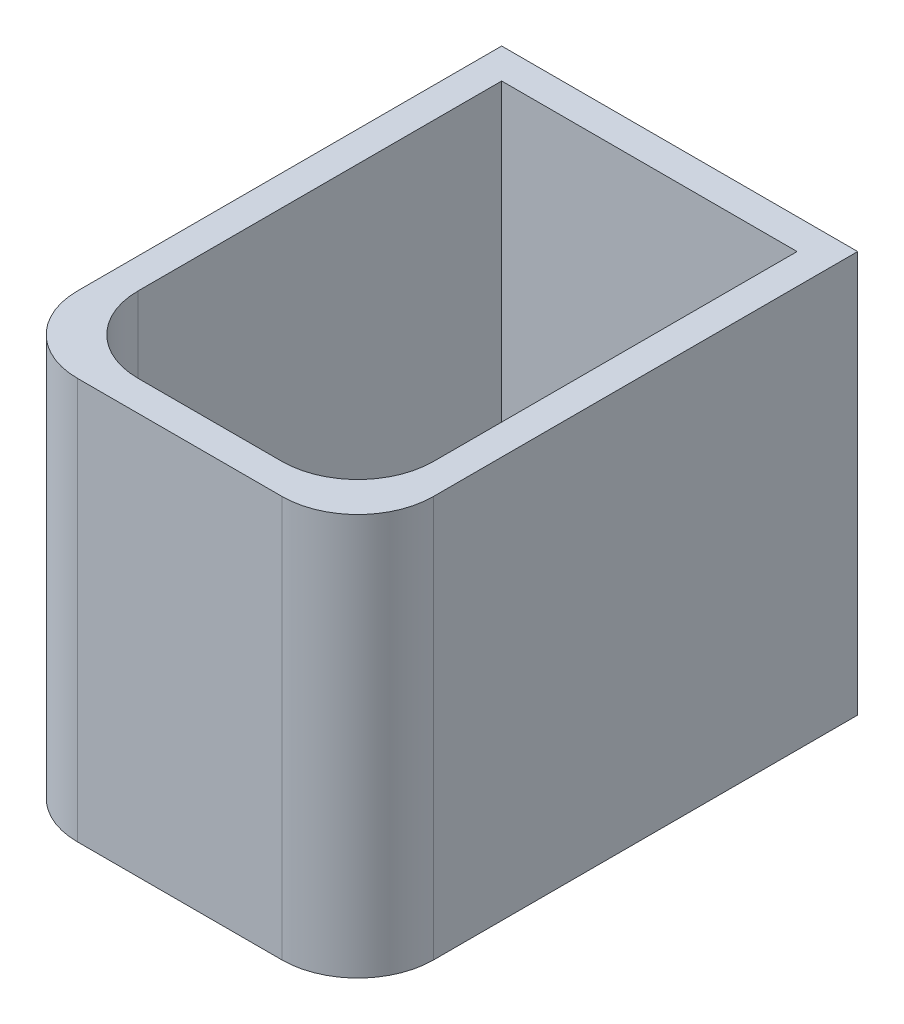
ISO-10303-21;
HEADER;
FILE_DESCRIPTION(('STEP AP214'),'2;1');
FILE_NAME('part.step','',(''),(''),'','','');
FILE_SCHEMA(('AUTOMOTIVE_DESIGN { 1 0 10303 214 1 1 1 1 }'));
ENDSEC;
DATA;
#1=APPLICATION_CONTEXT('core data for automotive mechanical design processes');
#2=APPLICATION_PROTOCOL_DEFINITION('international standard','automotive_design',2000,#1);
#3=PRODUCT_CONTEXT('',#1,'mechanical');
#4=PRODUCT('Part','Part','',(#3));
#5=PRODUCT_RELATED_PRODUCT_CATEGORY('part','',(#4));
#6=PRODUCT_DEFINITION_FORMATION('','',#4);
#7=PRODUCT_DEFINITION_CONTEXT('part definition',#1,'design');
#8=PRODUCT_DEFINITION('design','',#6,#7);
#9=PRODUCT_DEFINITION_SHAPE('','',#8);
#10=(LENGTH_UNIT() NAMED_UNIT(*) SI_UNIT(.MILLI.,.METRE.));
#11=(NAMED_UNIT(*) PLANE_ANGLE_UNIT() SI_UNIT($,.RADIAN.));
#12=(NAMED_UNIT(*) SI_UNIT($,.STERADIAN.) SOLID_ANGLE_UNIT());
#13=UNCERTAINTY_MEASURE_WITH_UNIT(LENGTH_MEASURE(1.E-05),#10,'distance_accuracy_value','');
#14=(GEOMETRIC_REPRESENTATION_CONTEXT(3) GLOBAL_UNCERTAINTY_ASSIGNED_CONTEXT((#13)) GLOBAL_UNIT_ASSIGNED_CONTEXT((#10,
#11,#12)) REPRESENTATION_CONTEXT('',''));
#15=CARTESIAN_POINT('',(0.,0.,0.));
#16=DIRECTION('',(0.,0.,1.));
#17=DIRECTION('',(1.,0.,0.));
#18=AXIS2_PLACEMENT_3D('',#15,#16,#17);
#19=CARTESIAN_POINT('',(2.35,0.3,3.3));
#20=DIRECTION('',(-1.,0.,0.));
#21=DIRECTION('',(0.,0.,1.));
#22=AXIS2_PLACEMENT_3D('',#19,#20,#21);
#23=PLANE('',#22);
#24=DIRECTION('',(0.,0.,-1.));
#25=VECTOR('',#24,1.);
#26=CARTESIAN_POINT('',(2.35,5.3,3.3));
#27=LINE('',#26,#25);
#28=CARTESIAN_POINT('',(2.35,5.3,2.3));
#29=VERTEX_POINT('',#28);
#30=CARTESIAN_POINT('',(2.35,5.3,-3.3));
#31=VERTEX_POINT('',#30);
#32=EDGE_CURVE('E141',#29,#31,#27,.T.);
#33=ORIENTED_EDGE('',*,*,#32,.F.);
#34=DIRECTION('',(0.,-1.,0.));
#35=VECTOR('',#34,1.);
#36=CARTESIAN_POINT('',(2.35,0.3,2.3));
#37=LINE('',#36,#35);
#38=CARTESIAN_POINT('',(2.35,0.,2.3));
#39=VERTEX_POINT('',#38);
#40=EDGE_CURVE('E214',#29,#39,#37,.T.);
#41=ORIENTED_EDGE('',*,*,#40,.T.);
#42=DIRECTION('',(0.,0.,-1.));
#43=VECTOR('',#42,1.);
#44=CARTESIAN_POINT('',(2.35,0.,3.3));
#45=LINE('',#44,#43);
#46=CARTESIAN_POINT('',(2.35,0.,-3.3));
#47=VERTEX_POINT('',#46);
#48=EDGE_CURVE('E172',#39,#47,#45,.T.);
#49=ORIENTED_EDGE('',*,*,#48,.T.);
#50=DIRECTION('',(0.,-1.,0.));
#51=VECTOR('',#50,1.);
#52=CARTESIAN_POINT('',(2.35,0.3,-3.3));
#53=LINE('',#52,#51);
#54=EDGE_CURVE('E185',#31,#47,#53,.T.);
#55=ORIENTED_EDGE('',*,*,#54,.F.);
#56=EDGE_LOOP('',(#33,#41,#49,#55));
#57=FACE_BOUND('',#56,.T.);
#58=ADVANCED_FACE('F36',(#57),#23,.F.);
#59=CARTESIAN_POINT('',(-2.35,0.3,-3.3));
#60=DIRECTION('',(0.,0.,1.));
#61=DIRECTION('',(1.,0.,0.));
#62=AXIS2_PLACEMENT_3D('',#59,#60,#61);
#63=PLANE('',#62);
#64=DIRECTION('',(-1.,0.,0.));
#65=VECTOR('',#64,1.);
#66=CARTESIAN_POINT('',(-2.35,0.,-3.3));
#67=LINE('',#66,#65);
#68=CARTESIAN_POINT('',(-2.35,0.,-3.3));
#69=VERTEX_POINT('',#68);
#70=EDGE_CURVE('E174',#47,#69,#67,.T.);
#71=ORIENTED_EDGE('',*,*,#70,.T.);
#72=DIRECTION('',(0.,-1.,0.));
#73=VECTOR('',#72,1.);
#74=CARTESIAN_POINT('',(-2.35,0.3,-3.3));
#75=LINE('',#74,#73);
#76=CARTESIAN_POINT('',(-2.35,5.3,-3.3));
#77=VERTEX_POINT('',#76);
#78=EDGE_CURVE('E182',#77,#69,#75,.T.);
#79=ORIENTED_EDGE('',*,*,#78,.F.);
#80=DIRECTION('',(-1.,0.,0.));
#81=VECTOR('',#80,1.);
#82=CARTESIAN_POINT('',(-2.35,5.3,-3.3));
#83=LINE('',#82,#81);
#84=EDGE_CURVE('E163',#31,#77,#83,.T.);
#85=ORIENTED_EDGE('',*,*,#84,.F.);
#86=ORIENTED_EDGE('',*,*,#54,.T.);
#87=EDGE_LOOP('',(#71,#79,#85,#86));
#88=FACE_BOUND('',#87,.T.);
#89=ADVANCED_FACE('F239',(#88),#63,.F.);
#90=CARTESIAN_POINT('',(-2.35,0.3,3.3));
#91=DIRECTION('',(1.,0.,0.));
#92=DIRECTION('',(0.,0.,-1.));
#93=AXIS2_PLACEMENT_3D('',#90,#91,#92);
#94=PLANE('',#93);
#95=DIRECTION('',(0.,0.,1.));
#96=VECTOR('',#95,1.);
#97=CARTESIAN_POINT('',(-2.35,0.,3.3));
#98=LINE('',#97,#96);
#99=CARTESIAN_POINT('',(-2.35,0.,2.3));
#100=VERTEX_POINT('',#99);
#101=EDGE_CURVE('E176',#69,#100,#98,.T.);
#102=ORIENTED_EDGE('',*,*,#101,.T.);
#103=DIRECTION('',(0.,-1.,0.));
#104=VECTOR('',#103,1.);
#105=CARTESIAN_POINT('',(-2.35,0.3,2.3));
#106=LINE('',#105,#104);
#107=CARTESIAN_POINT('',(-2.35,5.3,2.3));
#108=VERTEX_POINT('',#107);
#109=EDGE_CURVE('E197',#100,#108,#106,.F.);
#110=ORIENTED_EDGE('',*,*,#109,.T.);
#111=DIRECTION('',(0.,0.,1.));
#112=VECTOR('',#111,1.);
#113=CARTESIAN_POINT('',(-2.35,5.3,3.3));
#114=LINE('',#113,#112);
#115=EDGE_CURVE('E166',#77,#108,#114,.T.);
#116=ORIENTED_EDGE('',*,*,#115,.F.);
#117=ORIENTED_EDGE('',*,*,#78,.T.);
#118=EDGE_LOOP('',(#102,#110,#116,#117));
#119=FACE_BOUND('',#118,.T.);
#120=ADVANCED_FACE('F245',(#119),#94,.F.);
#121=CARTESIAN_POINT('',(-2.35,0.3,3.3));
#122=DIRECTION('',(0.,0.,-1.));
#123=DIRECTION('',(-1.,0.,0.));
#124=AXIS2_PLACEMENT_3D('',#121,#122,#123);
#125=PLANE('',#124);
#126=DIRECTION('',(1.,0.,0.));
#127=VECTOR('',#126,1.);
#128=CARTESIAN_POINT('',(-2.35,5.3,3.3));
#129=LINE('',#128,#127);
#130=CARTESIAN_POINT('',(-1.35,5.3,3.3));
#131=VERTEX_POINT('',#130);
#132=CARTESIAN_POINT('',(1.35,5.3,3.3));
#133=VERTEX_POINT('',#132);
#134=EDGE_CURVE('E169',#131,#133,#129,.T.);
#135=ORIENTED_EDGE('',*,*,#134,.F.);
#136=DIRECTION('',(0.,-1.,0.));
#137=VECTOR('',#136,1.);
#138=CARTESIAN_POINT('',(-1.35,0.3,3.3));
#139=LINE('',#138,#137);
#140=CARTESIAN_POINT('',(-1.35,0.,3.3));
#141=VERTEX_POINT('',#140);
#142=EDGE_CURVE('E190',#131,#141,#139,.T.);
#143=ORIENTED_EDGE('',*,*,#142,.T.);
#144=DIRECTION('',(1.,0.,0.));
#145=VECTOR('',#144,1.);
#146=CARTESIAN_POINT('',(-2.35,0.,3.3));
#147=LINE('',#146,#145);
#148=CARTESIAN_POINT('',(1.35,0.,3.3));
#149=VERTEX_POINT('',#148);
#150=EDGE_CURVE('E179',#141,#149,#147,.T.);
#151=ORIENTED_EDGE('',*,*,#150,.T.);
#152=DIRECTION('',(0.,-1.,0.));
#153=VECTOR('',#152,1.);
#154=CARTESIAN_POINT('',(1.35,0.3,3.3));
#155=LINE('',#154,#153);
#156=EDGE_CURVE('E188',#149,#133,#155,.F.);
#157=ORIENTED_EDGE('',*,*,#156,.T.);
#158=EDGE_LOOP('',(#135,#143,#151,#157));
#159=FACE_BOUND('',#158,.T.);
#160=ADVANCED_FACE('F265',(#159),#125,.F.);
#161=CARTESIAN_POINT('',(0.,0.,0.));
#162=DIRECTION('',(0.,-1.,0.));
#163=DIRECTION('',(0.,0.,-1.));
#164=AXIS2_PLACEMENT_3D('',#161,#162,#163);
#165=PLANE('',#164);
#166=ORIENTED_EDGE('',*,*,#150,.F.);
#167=CARTESIAN_POINT('',(-1.35,0.,2.3));
#168=DIRECTION('',(0.,-1.,0.));
#169=DIRECTION('',(0.,0.,-1.));
#170=AXIS2_PLACEMENT_3D('',#167,#168,#169);
#171=CIRCLE('',#170,1.);
#172=EDGE_CURVE('E195',#141,#100,#171,.T.);
#173=ORIENTED_EDGE('',*,*,#172,.T.);
#174=ORIENTED_EDGE('',*,*,#101,.F.);
#175=ORIENTED_EDGE('',*,*,#70,.F.);
#176=ORIENTED_EDGE('',*,*,#48,.F.);
#177=CARTESIAN_POINT('',(1.35,0.,2.3));
#178=DIRECTION('',(0.,-1.,0.));
#179=DIRECTION('',(0.,0.,-1.));
#180=AXIS2_PLACEMENT_3D('',#177,#178,#179);
#181=CIRCLE('',#180,1.);
#182=EDGE_CURVE('E193',#39,#149,#181,.T.);
#183=ORIENTED_EDGE('',*,*,#182,.T.);
#184=EDGE_LOOP('',(#166,#173,#174,#175,#176,#183));
#185=FACE_BOUND('',#184,.T.);
#186=ADVANCED_FACE('F276',(#185),#165,.T.);
#187=CARTESIAN_POINT('',(0.,5.3,0.));
#188=DIRECTION('',(0.,-1.,0.));
#189=DIRECTION('',(0.,0.,-1.));
#190=AXIS2_PLACEMENT_3D('',#187,#188,#189);
#191=PLANE('',#190);
#192=ORIENTED_EDGE('',*,*,#115,.T.);
#193=CARTESIAN_POINT('',(-1.35,5.3,2.3));
#194=DIRECTION('',(0.,-1.,0.));
#195=DIRECTION('',(0.,0.,-1.));
#196=AXIS2_PLACEMENT_3D('',#193,#194,#195);
#197=CIRCLE('',#196,1.);
#198=EDGE_CURVE('E201',#108,#131,#197,.F.);
#199=ORIENTED_EDGE('',*,*,#198,.T.);
#200=ORIENTED_EDGE('',*,*,#134,.T.);
#201=CARTESIAN_POINT('',(1.35,5.3,2.3));
#202=DIRECTION('',(0.,-1.,0.));
#203=DIRECTION('',(0.,0.,-1.));
#204=AXIS2_PLACEMENT_3D('',#201,#202,#203);
#205=CIRCLE('',#204,1.);
#206=EDGE_CURVE('E199',#133,#29,#205,.F.);
#207=ORIENTED_EDGE('',*,*,#206,.T.);
#208=ORIENTED_EDGE('',*,*,#32,.T.);
#209=ORIENTED_EDGE('',*,*,#84,.T.);
#210=EDGE_LOOP('',(#192,#199,#200,#207,#208,#209));
#211=FACE_BOUND('',#210,.T.);
#212=DIRECTION('',(0.,0.,-1.));
#213=VECTOR('',#212,1.);
#214=CARTESIAN_POINT('',(1.95,5.3,2.9));
#215=LINE('',#214,#213);
#216=CARTESIAN_POINT('',(1.95,5.3,1.9));
#217=VERTEX_POINT('',#216);
#218=CARTESIAN_POINT('',(1.95,5.3,-2.9));
#219=VERTEX_POINT('',#218);
#220=EDGE_CURVE('E124',#217,#219,#215,.T.);
#221=ORIENTED_EDGE('',*,*,#220,.F.);
#222=CARTESIAN_POINT('',(0.950000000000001,5.3,1.9));
#223=DIRECTION('',(0.,-1.,0.));
#224=DIRECTION('',(0.,0.,-1.));
#225=AXIS2_PLACEMENT_3D('',#222,#223,#224);
#226=CIRCLE('',#225,1.);
#227=CARTESIAN_POINT('',(0.950000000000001,5.3,2.9));
#228=VERTEX_POINT('',#227);
#229=EDGE_CURVE('E11',#217,#228,#226,.T.);
#230=ORIENTED_EDGE('',*,*,#229,.T.);
#231=DIRECTION('',(1.,0.,0.));
#232=VECTOR('',#231,1.);
#233=CARTESIAN_POINT('',(-1.95,5.3,2.9));
#234=LINE('',#233,#232);
#235=CARTESIAN_POINT('',(-0.95,5.3,2.9));
#236=VERTEX_POINT('',#235);
#237=EDGE_CURVE('E149',#236,#228,#234,.T.);
#238=ORIENTED_EDGE('',*,*,#237,.F.);
#239=CARTESIAN_POINT('',(-0.95,5.3,1.9));
#240=DIRECTION('',(0.,-1.,0.));
#241=DIRECTION('',(0.,0.,-1.));
#242=AXIS2_PLACEMENT_3D('',#239,#240,#241);
#243=CIRCLE('',#242,1.);
#244=CARTESIAN_POINT('',(-1.95,5.3,1.9));
#245=VERTEX_POINT('',#244);
#246=EDGE_CURVE('E44',#236,#245,#243,.T.);
#247=ORIENTED_EDGE('',*,*,#246,.T.);
#248=DIRECTION('',(0.,0.,1.));
#249=VECTOR('',#248,1.);
#250=CARTESIAN_POINT('',(-1.95,5.3,2.9));
#251=LINE('',#250,#249);
#252=CARTESIAN_POINT('',(-1.95,5.3,-2.9));
#253=VERTEX_POINT('',#252);
#254=EDGE_CURVE('E147',#253,#245,#251,.T.);
#255=ORIENTED_EDGE('',*,*,#254,.F.);
#256=DIRECTION('',(-1.,0.,0.));
#257=VECTOR('',#256,1.);
#258=CARTESIAN_POINT('',(-1.95,5.3,-2.9));
#259=LINE('',#258,#257);
#260=EDGE_CURVE('E132',#219,#253,#259,.T.);
#261=ORIENTED_EDGE('',*,*,#260,.F.);
#262=EDGE_LOOP('',(#221,#230,#238,#247,#255,#261));
#263=FACE_BOUND('',#262,.T.);
#264=ADVANCED_FACE('F145',(#211,#263),#191,.F.);
#265=CARTESIAN_POINT('',(1.95,5.3,2.9));
#266=DIRECTION('',(-1.,0.,0.));
#267=DIRECTION('',(0.,0.,1.));
#268=AXIS2_PLACEMENT_3D('',#265,#266,#267);
#269=PLANE('',#268);
#270=DIRECTION('',(0.,0.,-1.));
#271=VECTOR('',#270,1.);
#272=CARTESIAN_POINT('',(1.95,0.3,2.9));
#273=LINE('',#272,#271);
#274=CARTESIAN_POINT('',(1.95,0.3,1.9));
#275=VERTEX_POINT('',#274);
#276=CARTESIAN_POINT('',(1.95,0.3,-2.9));
#277=VERTEX_POINT('',#276);
#278=EDGE_CURVE('E154',#275,#277,#273,.T.);
#279=ORIENTED_EDGE('',*,*,#278,.F.);
#280=DIRECTION('',(0.,-1.,0.));
#281=VECTOR('',#280,1.);
#282=CARTESIAN_POINT('',(1.95,5.3,1.9));
#283=LINE('',#282,#281);
#284=EDGE_CURVE('E128',#275,#217,#283,.F.);
#285=ORIENTED_EDGE('',*,*,#284,.T.);
#286=ORIENTED_EDGE('',*,*,#220,.T.);
#287=DIRECTION('',(0.,-1.,0.));
#288=VECTOR('',#287,1.);
#289=CARTESIAN_POINT('',(1.95,5.3,-2.9));
#290=LINE('',#289,#288);
#291=EDGE_CURVE('E127',#219,#277,#290,.T.);
#292=ORIENTED_EDGE('',*,*,#291,.T.);
#293=EDGE_LOOP('',(#279,#285,#286,#292));
#294=FACE_BOUND('',#293,.T.);
#295=ADVANCED_FACE('F126',(#294),#269,.T.);
#296=CARTESIAN_POINT('',(-1.95,5.3,-2.9));
#297=DIRECTION('',(0.,0.,1.));
#298=DIRECTION('',(1.,0.,0.));
#299=AXIS2_PLACEMENT_3D('',#296,#297,#298);
#300=PLANE('',#299);
#301=DIRECTION('',(-1.,0.,0.));
#302=VECTOR('',#301,1.);
#303=CARTESIAN_POINT('',(-1.95,0.3,-2.9));
#304=LINE('',#303,#302);
#305=CARTESIAN_POINT('',(-1.95,0.3,-2.9));
#306=VERTEX_POINT('',#305);
#307=EDGE_CURVE('E140',#277,#306,#304,.T.);
#308=ORIENTED_EDGE('',*,*,#307,.F.);
#309=ORIENTED_EDGE('',*,*,#291,.F.);
#310=ORIENTED_EDGE('',*,*,#260,.T.);
#311=DIRECTION('',(0.,-1.,0.));
#312=VECTOR('',#311,1.);
#313=CARTESIAN_POINT('',(-1.95,5.3,-2.9));
#314=LINE('',#313,#312);
#315=EDGE_CURVE('E142',#253,#306,#314,.T.);
#316=ORIENTED_EDGE('',*,*,#315,.T.);
#317=EDGE_LOOP('',(#308,#309,#310,#316));
#318=FACE_BOUND('',#317,.T.);
#319=ADVANCED_FACE('F137',(#318),#300,.T.);
#320=CARTESIAN_POINT('',(-1.95,5.3,2.9));
#321=DIRECTION('',(1.,0.,0.));
#322=DIRECTION('',(0.,0.,-1.));
#323=AXIS2_PLACEMENT_3D('',#320,#321,#322);
#324=PLANE('',#323);
#325=ORIENTED_EDGE('',*,*,#254,.T.);
#326=DIRECTION('',(0.,-1.,0.));
#327=VECTOR('',#326,1.);
#328=CARTESIAN_POINT('',(-1.95,0.3,1.9));
#329=LINE('',#328,#327);
#330=CARTESIAN_POINT('',(-1.95,0.3,1.9));
#331=VERTEX_POINT('',#330);
#332=EDGE_CURVE('E203',#245,#331,#329,.T.);
#333=ORIENTED_EDGE('',*,*,#332,.T.);
#334=DIRECTION('',(0.,0.,1.));
#335=VECTOR('',#334,1.);
#336=CARTESIAN_POINT('',(-1.95,0.3,2.9));
#337=LINE('',#336,#335);
#338=EDGE_CURVE('E157',#306,#331,#337,.T.);
#339=ORIENTED_EDGE('',*,*,#338,.F.);
#340=ORIENTED_EDGE('',*,*,#315,.F.);
#341=EDGE_LOOP('',(#325,#333,#339,#340));
#342=FACE_BOUND('',#341,.T.);
#343=ADVANCED_FACE('F222',(#342),#324,.T.);
#344=CARTESIAN_POINT('',(-1.95,5.3,2.9));
#345=DIRECTION('',(0.,0.,-1.));
#346=DIRECTION('',(-1.,0.,0.));
#347=AXIS2_PLACEMENT_3D('',#344,#345,#346);
#348=PLANE('',#347);
#349=DIRECTION('',(1.,0.,0.));
#350=VECTOR('',#349,1.);
#351=CARTESIAN_POINT('',(-1.95,0.3,2.9));
#352=LINE('',#351,#350);
#353=CARTESIAN_POINT('',(-0.95,0.3,2.9));
#354=VERTEX_POINT('',#353);
#355=CARTESIAN_POINT('',(0.950000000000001,0.3,2.9));
#356=VERTEX_POINT('',#355);
#357=EDGE_CURVE('E133',#354,#356,#352,.T.);
#358=ORIENTED_EDGE('',*,*,#357,.F.);
#359=DIRECTION('',(0.,-1.,0.));
#360=VECTOR('',#359,1.);
#361=CARTESIAN_POINT('',(-0.95,5.3,2.9));
#362=LINE('',#361,#360);
#363=EDGE_CURVE('E211',#354,#236,#362,.F.);
#364=ORIENTED_EDGE('',*,*,#363,.T.);
#365=ORIENTED_EDGE('',*,*,#237,.T.);
#366=DIRECTION('',(0.,-1.,0.));
#367=VECTOR('',#366,1.);
#368=CARTESIAN_POINT('',(0.950000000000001,0.3,2.9));
#369=LINE('',#368,#367);
#370=EDGE_CURVE('E209',#228,#356,#369,.T.);
#371=ORIENTED_EDGE('',*,*,#370,.T.);
#372=EDGE_LOOP('',(#358,#364,#365,#371));
#373=FACE_BOUND('',#372,.T.);
#374=ADVANCED_FACE('F228',(#373),#348,.T.);
#375=CARTESIAN_POINT('',(0.,0.3,0.));
#376=DIRECTION('',(0.,-1.,0.));
#377=DIRECTION('',(0.,0.,-1.));
#378=AXIS2_PLACEMENT_3D('',#375,#376,#377);
#379=PLANE('',#378);
#380=ORIENTED_EDGE('',*,*,#338,.T.);
#381=CARTESIAN_POINT('',(-0.95,0.3,1.9));
#382=DIRECTION('',(0.,-1.,0.));
#383=DIRECTION('',(0.,0.,-1.));
#384=AXIS2_PLACEMENT_3D('',#381,#382,#383);
#385=CIRCLE('',#384,1.);
#386=EDGE_CURVE('E207',#331,#354,#385,.F.);
#387=ORIENTED_EDGE('',*,*,#386,.T.);
#388=ORIENTED_EDGE('',*,*,#357,.T.);
#389=CARTESIAN_POINT('',(0.950000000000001,0.3,1.9));
#390=DIRECTION('',(0.,-1.,0.));
#391=DIRECTION('',(0.,0.,-1.));
#392=AXIS2_PLACEMENT_3D('',#389,#390,#391);
#393=CIRCLE('',#392,1.);
#394=EDGE_CURVE('E51',#356,#275,#393,.F.);
#395=ORIENTED_EDGE('',*,*,#394,.T.);
#396=ORIENTED_EDGE('',*,*,#278,.T.);
#397=ORIENTED_EDGE('',*,*,#307,.T.);
#398=EDGE_LOOP('',(#380,#387,#388,#395,#396,#397));
#399=FACE_BOUND('',#398,.T.);
#400=ADVANCED_FACE('F226',(#399),#379,.F.);
#401=CARTESIAN_POINT('',(-1.35,0.3,2.3));
#402=DIRECTION('',(0.,-1.,0.));
#403=DIRECTION('',(0.,0.,-1.));
#404=AXIS2_PLACEMENT_3D('',#401,#402,#403);
#405=CYLINDRICAL_SURFACE('',#404,1.);
#406=ORIENTED_EDGE('',*,*,#198,.F.);
#407=ORIENTED_EDGE('',*,*,#109,.F.);
#408=ORIENTED_EDGE('',*,*,#172,.F.);
#409=ORIENTED_EDGE('',*,*,#142,.F.);
#410=EDGE_LOOP('',(#406,#407,#408,#409));
#411=FACE_BOUND('',#410,.T.);
#412=ADVANCED_FACE('F236',(#411),#405,.T.);
#413=CARTESIAN_POINT('',(-0.95,5.3,1.9));
#414=DIRECTION('',(0.,1.,0.));
#415=DIRECTION('',(0.,0.,1.));
#416=AXIS2_PLACEMENT_3D('',#413,#414,#415);
#417=CYLINDRICAL_SURFACE('',#416,1.);
#418=ORIENTED_EDGE('',*,*,#246,.F.);
#419=ORIENTED_EDGE('',*,*,#363,.F.);
#420=ORIENTED_EDGE('',*,*,#386,.F.);
#421=ORIENTED_EDGE('',*,*,#332,.F.);
#422=EDGE_LOOP('',(#418,#419,#420,#421));
#423=FACE_BOUND('',#422,.T.);
#424=ADVANCED_FACE('F224',(#423),#417,.F.);
#425=CARTESIAN_POINT('',(0.950000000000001,5.3,1.9));
#426=DIRECTION('',(0.,1.,0.));
#427=DIRECTION('',(0.,0.,1.));
#428=AXIS2_PLACEMENT_3D('',#425,#426,#427);
#429=CYLINDRICAL_SURFACE('',#428,1.);
#430=ORIENTED_EDGE('',*,*,#229,.F.);
#431=ORIENTED_EDGE('',*,*,#284,.F.);
#432=ORIENTED_EDGE('',*,*,#394,.F.);
#433=ORIENTED_EDGE('',*,*,#370,.F.);
#434=EDGE_LOOP('',(#430,#431,#432,#433));
#435=FACE_BOUND('',#434,.T.);
#436=ADVANCED_FACE('F229',(#435),#429,.F.);
#437=CARTESIAN_POINT('',(1.35,0.3,2.3));
#438=DIRECTION('',(0.,-1.,0.));
#439=DIRECTION('',(0.,0.,-1.));
#440=AXIS2_PLACEMENT_3D('',#437,#438,#439);
#441=CYLINDRICAL_SURFACE('',#440,1.);
#442=ORIENTED_EDGE('',*,*,#206,.F.);
#443=ORIENTED_EDGE('',*,*,#156,.F.);
#444=ORIENTED_EDGE('',*,*,#182,.F.);
#445=ORIENTED_EDGE('',*,*,#40,.F.);
#446=EDGE_LOOP('',(#442,#443,#444,#445));
#447=FACE_BOUND('',#446,.T.);
#448=ADVANCED_FACE('F38',(#447),#441,.T.);
#449=CLOSED_SHELL('',(#58,#89,#120,#160,#186,#264,#295,#319,#343,#374,#400,#412,#424,#436,#448));
#450=MANIFOLD_SOLID_BREP('B2',#449);
#451=ADVANCED_BREP_SHAPE_REPRESENTATION('',(#18,#450),#14);
#452=SHAPE_DEFINITION_REPRESENTATION(#9,#451);
ENDSEC;
END-ISO-10303-21;
